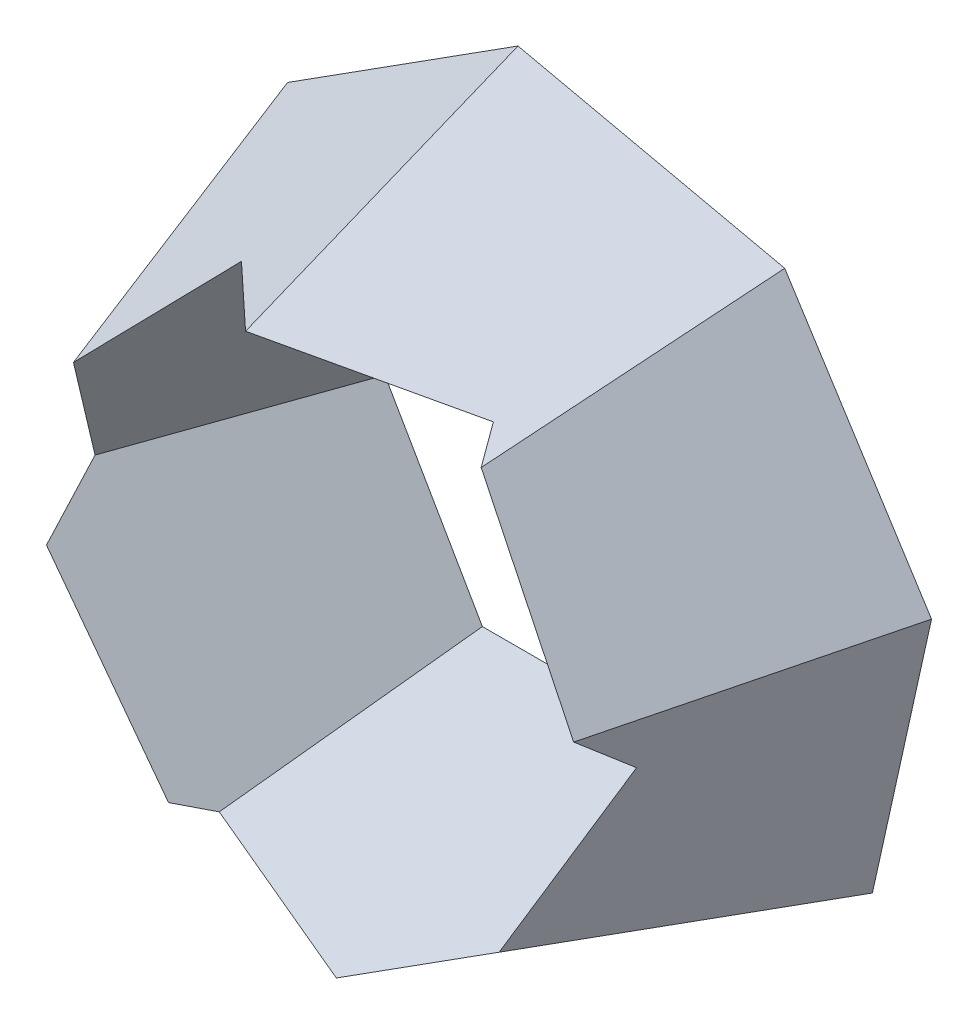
ISO-10303-21;
HEADER;
FILE_DESCRIPTION(('STEP AP214'),'2;1');
FILE_NAME('part.step','',(''),(''),'','','');
FILE_SCHEMA(('AUTOMOTIVE_DESIGN { 1 0 10303 214 1 1 1 1 }'));
ENDSEC;
DATA;
#1=APPLICATION_CONTEXT('core data for automotive mechanical design processes');
#2=APPLICATION_PROTOCOL_DEFINITION('international standard','automotive_design',2000,#1);
#3=PRODUCT_CONTEXT('',#1,'mechanical');
#4=PRODUCT('Part','Part','',(#3));
#5=PRODUCT_RELATED_PRODUCT_CATEGORY('part','',(#4));
#6=PRODUCT_DEFINITION_FORMATION('','',#4);
#7=PRODUCT_DEFINITION_CONTEXT('part definition',#1,'design');
#8=PRODUCT_DEFINITION('design','',#6,#7);
#9=PRODUCT_DEFINITION_SHAPE('','',#8);
#10=(LENGTH_UNIT() NAMED_UNIT(*) SI_UNIT(.MILLI.,.METRE.));
#11=(NAMED_UNIT(*) PLANE_ANGLE_UNIT() SI_UNIT($,.RADIAN.));
#12=(NAMED_UNIT(*) SI_UNIT($,.STERADIAN.) SOLID_ANGLE_UNIT());
#13=UNCERTAINTY_MEASURE_WITH_UNIT(LENGTH_MEASURE(1.E-05),#10,'distance_accuracy_value','');
#14=(GEOMETRIC_REPRESENTATION_CONTEXT(3) GLOBAL_UNCERTAINTY_ASSIGNED_CONTEXT((#13)) GLOBAL_UNIT_ASSIGNED_CONTEXT((#10,
#11,#12)) REPRESENTATION_CONTEXT('',''));
#15=CARTESIAN_POINT('',(0.,0.,0.));
#16=DIRECTION('',(0.,0.,1.));
#17=DIRECTION('',(1.,0.,0.));
#18=AXIS2_PLACEMENT_3D('',#15,#16,#17);
#19=CARTESIAN_POINT('',(12.9319936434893,58.3324536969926,0.));
#20=DIRECTION('',(0.,0.,-1.));
#21=DIRECTION('',(-1.,0.,0.));
#22=AXIS2_PLACEMENT_3D('',#19,#20,#21);
#23=PLANE('',#22);
#24=DIRECTION('',(-0.843391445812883,-0.537299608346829,0.));
#25=VECTOR('',#24,1.);
#26=CARTESIAN_POINT('',(-7.94087972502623,45.0349668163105,0.));
#27=LINE('',#26,#25);
#28=CARTESIAN_POINT('',(-7.94087972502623,45.0349668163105,0.));
#29=VERTEX_POINT('',#28);
#30=CARTESIAN_POINT('',(-37.4595803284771,26.2294805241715,0.));
#31=VERTEX_POINT('',#30);
#32=EDGE_CURVE('E139',#29,#31,#27,.T.);
#33=ORIENTED_EDGE('',*,*,#32,.F.);
#34=DIRECTION('',(-0.976296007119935,0.216439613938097,0.));
#35=VECTOR('',#34,1.);
#36=CARTESIAN_POINT('',(26.2294805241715,37.4595803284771,0.));
#37=LINE('',#36,#35);
#38=CARTESIAN_POINT('',(26.2294805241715,37.4595803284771,0.));
#39=VERTEX_POINT('',#38);
#40=EDGE_CURVE('E184',#39,#29,#37,.T.);
#41=ORIENTED_EDGE('',*,*,#40,.F.);
#42=DIRECTION('',(-0.537299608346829,0.843391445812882,0.));
#43=VECTOR('',#42,1.);
#44=CARTESIAN_POINT('',(45.0349668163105,7.94087972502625,0.));
#45=LINE('',#44,#43);
#46=CARTESIAN_POINT('',(45.0349668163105,7.94087972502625,0.));
#47=VERTEX_POINT('',#46);
#48=EDGE_CURVE('E181',#47,#39,#45,.T.);
#49=ORIENTED_EDGE('',*,*,#48,.F.);
#50=DIRECTION('',(0.216439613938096,0.976296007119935,0.));
#51=VECTOR('',#50,1.);
#52=CARTESIAN_POINT('',(37.4595803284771,-26.2294805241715,0.));
#53=LINE('',#52,#51);
#54=CARTESIAN_POINT('',(37.4595803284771,-26.2294805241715,0.));
#55=VERTEX_POINT('',#54);
#56=EDGE_CURVE('E178',#55,#47,#53,.T.);
#57=ORIENTED_EDGE('',*,*,#56,.F.);
#58=DIRECTION('',(0.843391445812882,0.537299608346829,0.));
#59=VECTOR('',#58,1.);
#60=CARTESIAN_POINT('',(7.94087972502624,-45.0349668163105,0.));
#61=LINE('',#60,#59);
#62=CARTESIAN_POINT('',(7.94087972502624,-45.0349668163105,0.));
#63=VERTEX_POINT('',#62);
#64=EDGE_CURVE('E175',#63,#55,#61,.T.);
#65=ORIENTED_EDGE('',*,*,#64,.F.);
#66=DIRECTION('',(0.976296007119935,-0.216439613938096,0.));
#67=VECTOR('',#66,1.);
#68=CARTESIAN_POINT('',(-26.2294805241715,-37.4595803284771,0.));
#69=LINE('',#68,#67);
#70=CARTESIAN_POINT('',(-26.2294805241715,-37.4595803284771,0.));
#71=VERTEX_POINT('',#70);
#72=EDGE_CURVE('E172',#71,#63,#69,.T.);
#73=ORIENTED_EDGE('',*,*,#72,.F.);
#74=DIRECTION('',(0.537299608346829,-0.843391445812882,0.));
#75=VECTOR('',#74,1.);
#76=CARTESIAN_POINT('',(-45.0349668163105,-7.94087972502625,0.));
#77=LINE('',#76,#75);
#78=CARTESIAN_POINT('',(-45.0349668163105,-7.94087972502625,0.));
#79=VERTEX_POINT('',#78);
#80=EDGE_CURVE('E169',#79,#71,#77,.T.);
#81=ORIENTED_EDGE('',*,*,#80,.F.);
#82=DIRECTION('',(-0.216439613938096,-0.976296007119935,0.));
#83=VECTOR('',#82,1.);
#84=CARTESIAN_POINT('',(-37.4595803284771,26.2294805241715,0.));
#85=LINE('',#84,#83);
#86=EDGE_CURVE('E166',#31,#79,#85,.T.);
#87=ORIENTED_EDGE('',*,*,#86,.F.);
#88=EDGE_LOOP('',(#33,#41,#49,#57,#65,#73,#81,#87));
#89=FACE_BOUND('',#88,.T.);
#90=DIRECTION('',(1.,0.,0.));
#91=VECTOR('',#90,1.);
#92=CARTESIAN_POINT('',(-12.5,-21.650635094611,0.));
#93=LINE('',#92,#91);
#94=CARTESIAN_POINT('',(-12.5,-21.650635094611,0.));
#95=VERTEX_POINT('',#94);
#96=CARTESIAN_POINT('',(12.5,-21.650635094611,0.));
#97=VERTEX_POINT('',#96);
#98=EDGE_CURVE('E153',#95,#97,#93,.T.);
#99=ORIENTED_EDGE('',*,*,#98,.T.);
#100=DIRECTION('',(0.5,0.866025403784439,0.));
#101=VECTOR('',#100,1.);
#102=CARTESIAN_POINT('',(12.5,-21.650635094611,0.));
#103=LINE('',#102,#101);
#104=CARTESIAN_POINT('',(25.,0.,0.));
#105=VERTEX_POINT('',#104);
#106=EDGE_CURVE('E134',#97,#105,#103,.T.);
#107=ORIENTED_EDGE('',*,*,#106,.T.);
#108=DIRECTION('',(-0.5,0.866025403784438,0.));
#109=VECTOR('',#108,1.);
#110=CARTESIAN_POINT('',(25.,0.,0.));
#111=LINE('',#110,#109);
#112=CARTESIAN_POINT('',(12.5,21.650635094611,0.));
#113=VERTEX_POINT('',#112);
#114=EDGE_CURVE('E143',#105,#113,#111,.T.);
#115=ORIENTED_EDGE('',*,*,#114,.T.);
#116=DIRECTION('',(-1.,0.,0.));
#117=VECTOR('',#116,1.);
#118=CARTESIAN_POINT('',(12.5,21.650635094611,0.));
#119=LINE('',#118,#117);
#120=CARTESIAN_POINT('',(-12.5,21.650635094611,0.));
#121=VERTEX_POINT('',#120);
#122=EDGE_CURVE('E149',#113,#121,#119,.T.);
#123=ORIENTED_EDGE('',*,*,#122,.T.);
#124=DIRECTION('',(-0.5,-0.866025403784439,0.));
#125=VECTOR('',#124,1.);
#126=CARTESIAN_POINT('',(-12.5,21.650635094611,0.));
#127=LINE('',#126,#125);
#128=CARTESIAN_POINT('',(-25.,0.,0.));
#129=VERTEX_POINT('',#128);
#130=EDGE_CURVE('E157',#121,#129,#127,.T.);
#131=ORIENTED_EDGE('',*,*,#130,.T.);
#132=DIRECTION('',(0.5,-0.866025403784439,0.));
#133=VECTOR('',#132,1.);
#134=CARTESIAN_POINT('',(-25.,0.,0.));
#135=LINE('',#134,#133);
#136=EDGE_CURVE('E160',#129,#95,#135,.T.);
#137=ORIENTED_EDGE('',*,*,#136,.T.);
#138=EDGE_LOOP('',(#99,#107,#115,#123,#131,#137));
#139=FACE_BOUND('',#138,.T.);
#140=ADVANCED_FACE('F31',(#89,#139),#23,.T.);
#141=CARTESIAN_POINT('',(-7.94087972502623,45.0349668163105,0.));
#142=DIRECTION('',(-0.513822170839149,0.8065392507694,0.292371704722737));
#143=DIRECTION('',(-0.843391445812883,-0.537299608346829,0.));
#144=AXIS2_PLACEMENT_3D('',#141,#142,#143);
#145=PLANE('',#144);
#146=DIRECTION('',(0.708193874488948,0.206419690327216,0.67516838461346));
#147=VECTOR('',#146,1.);
#148=CARTESIAN_POINT('',(-22.8189869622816,28.0128996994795,20.8100298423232));
#149=LINE('',#148,#147);
#150=CARTESIAN_POINT('',(-5.81342457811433,32.9695691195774,37.0225649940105));
#151=VERTEX_POINT('',#150);
#152=CARTESIAN_POINT('',(-17.1305227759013,29.6709358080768,26.23322158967));
#153=VERTEX_POINT('',#152);
#154=EDGE_CURVE('E213',#151,#153,#149,.F.);
#155=ORIENTED_EDGE('',*,*,#154,.F.);
#156=DIRECTION('',(-0.0545542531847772,0.309392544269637,-0.949368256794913));
#157=VECTOR('',#156,1.);
#158=CARTESIAN_POINT('',(-7.94087972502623,45.0349668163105,0.));
#159=LINE('',#158,#157);
#160=EDGE_CURVE('E187',#151,#29,#159,.T.);
#161=ORIENTED_EDGE('',*,*,#160,.T.);
#162=ORIENTED_EDGE('',*,*,#32,.T.);
#163=DIRECTION('',(-0.257349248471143,0.180197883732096,-0.949368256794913));
#164=VECTOR('',#163,1.);
#165=CARTESIAN_POINT('',(-37.4595803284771,26.2294805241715,0.));
#166=LINE('',#165,#164);
#167=CARTESIAN_POINT('',(-27.2610822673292,19.0884153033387,37.6225319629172));
#168=VERTEX_POINT('',#167);
#169=EDGE_CURVE('E188',#168,#31,#166,.T.);
#170=ORIENTED_EDGE('',*,*,#169,.F.);
#171=DIRECTION('',(0.545937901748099,0.570294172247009,-0.613772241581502));
#172=VECTOR('',#171,1.);
#173=CARTESIAN_POINT('',(-0.817780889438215,46.7114482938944,7.89357504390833));
#174=LINE('',#173,#172);
#175=EDGE_CURVE('E190',#153,#168,#174,.F.);
#176=ORIENTED_EDGE('',*,*,#175,.F.);
#177=EDGE_LOOP('',(#155,#161,#162,#170,#176));
#178=FACE_BOUND('',#177,.T.);
#179=ADVANCED_FACE('F241',(#178),#145,.T.);
#180=CARTESIAN_POINT('',(-37.4595803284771,26.2294805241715,0.));
#181=DIRECTION('',(-0.933636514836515,0.206982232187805,0.292371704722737));
#182=DIRECTION('',(0.298843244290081,0.,0.954302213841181));
#183=AXIS2_PLACEMENT_3D('',#180,#181,#182);
#184=PLANE('',#183);
#185=DIRECTION('',(0.324488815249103,0.834421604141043,0.445474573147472));
#186=VECTOR('',#185,1.);
#187=CARTESIAN_POINT('',(-31.8397884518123,7.31429188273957,31.3366537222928));
#188=LINE('',#187,#186);
#189=CARTESIAN_POINT('',(-34.6841610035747,0.,27.4317559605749));
#190=VERTEX_POINT('',#189);
#191=EDGE_CURVE('E218',#168,#190,#188,.F.);
#192=ORIENTED_EDGE('',*,*,#191,.F.);
#193=ORIENTED_EDGE('',*,*,#169,.T.);
#194=ORIENTED_EDGE('',*,*,#86,.T.);
#195=DIRECTION('',(-0.309392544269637,-0.0545542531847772,-0.949368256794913));
#196=VECTOR('',#195,1.);
#197=CARTESIAN_POINT('',(-45.0349668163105,-7.94087972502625,0.));
#198=LINE('',#197,#196);
#199=CARTESIAN_POINT('',(-33.7677278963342,-5.95416150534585,34.5734219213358));
#200=VERTEX_POINT('',#199);
#201=EDGE_CURVE('E191',#200,#79,#198,.T.);
#202=ORIENTED_EDGE('',*,*,#201,.F.);
#203=DIRECTION('',(-0.0980856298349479,0.637272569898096,-0.764370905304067));
#204=VECTOR('',#203,1.);
#205=CARTESIAN_POINT('',(-38.4070592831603,24.1880585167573,-1.58039529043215));
#206=LINE('',#205,#204);
#207=EDGE_CURVE('E216',#190,#200,#206,.F.);
#208=ORIENTED_EDGE('',*,*,#207,.F.);
#209=EDGE_LOOP('',(#192,#193,#194,#202,#208));
#210=FACE_BOUND('',#209,.T.);
#211=ADVANCED_FACE('F253',(#210),#184,.T.);
#212=CARTESIAN_POINT('',(-45.0349668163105,-7.94087972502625,0.));
#213=DIRECTION('',(-0.8065392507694,-0.513822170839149,0.292371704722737));
#214=DIRECTION('',(0.537299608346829,-0.843391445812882,0.));
#215=AXIS2_PLACEMENT_3D('',#212,#213,#214);
#216=PLANE('',#215);
#217=DIRECTION('',(-0.517457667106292,0.85274384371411,0.071172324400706));
#218=VECTOR('',#217,1.);
#219=CARTESIAN_POINT('',(-34.6347213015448,-4.52540059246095,34.692670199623));
#220=LINE('',#219,#218);
#221=CARTESIAN_POINT('',(-20.0259142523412,-28.59996952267,32.6833410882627));
#222=VERTEX_POINT('',#221);
#223=EDGE_CURVE('E220',#200,#222,#220,.F.);
#224=ORIENTED_EDGE('',*,*,#223,.F.);
#225=ORIENTED_EDGE('',*,*,#201,.T.);
#226=ORIENTED_EDGE('',*,*,#80,.T.);
#227=DIRECTION('',(-0.180197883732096,-0.257349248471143,-0.949368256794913));
#228=VECTOR('',#227,1.);
#229=CARTESIAN_POINT('',(-26.2294805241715,-37.4595803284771,0.));
#230=LINE('',#229,#228);
#231=EDGE_CURVE('E201',#222,#71,#230,.T.);
#232=ORIENTED_EDGE('',*,*,#231,.F.);
#233=EDGE_LOOP('',(#224,#225,#226,#232));
#234=FACE_BOUND('',#233,.T.);
#235=ADVANCED_FACE('F284',(#234),#216,.T.);
#236=CARTESIAN_POINT('',(-26.2294805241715,-37.4595803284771,0.));
#237=DIRECTION('',(-0.206982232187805,-0.933636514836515,0.292371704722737));
#238=DIRECTION('',(0.,-0.298843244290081,-0.954302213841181));
#239=AXIS2_PLACEMENT_3D('',#236,#237,#238);
#240=PLANE('',#239);
#241=DIRECTION('',(-0.487605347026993,0.357527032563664,0.796502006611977));
#242=VECTOR('',#241,1.);
#243=CARTESIAN_POINT('',(-7.26284183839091,-37.9582414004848,11.834897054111));
#244=LINE('',#243,#242);
#245=CARTESIAN_POINT('',(-17.5572581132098,-30.4100630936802,28.6507980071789));
#246=VERTEX_POINT('',#245);
#247=EDGE_CURVE('E225',#222,#246,#244,.F.);
#248=ORIENTED_EDGE('',*,*,#247,.F.);
#249=ORIENTED_EDGE('',*,*,#231,.T.);
#250=ORIENTED_EDGE('',*,*,#72,.T.);
#251=DIRECTION('',(0.0545542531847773,-0.309392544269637,-0.949368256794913));
#252=VECTOR('',#251,1.);
#253=CARTESIAN_POINT('',(7.94087972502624,-45.0349668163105,0.));
#254=LINE('',#253,#252);
#255=CARTESIAN_POINT('',(5.81342457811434,-32.9695691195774,37.0225649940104));
#256=VERTEX_POINT('',#255);
#257=EDGE_CURVE('E199',#256,#63,#254,.T.);
#258=ORIENTED_EDGE('',*,*,#257,.F.);
#259=DIRECTION('',(-0.936457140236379,0.102558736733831,-0.335454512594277));
#260=VECTOR('',#259,1.);
#261=CARTESIAN_POINT('',(-33.4856584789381,-28.6656195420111,22.9449802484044));
#262=LINE('',#261,#260);
#263=EDGE_CURVE('E222',#246,#256,#262,.F.);
#264=ORIENTED_EDGE('',*,*,#263,.F.);
#265=EDGE_LOOP('',(#248,#249,#250,#258,#264));
#266=FACE_BOUND('',#265,.T.);
#267=ADVANCED_FACE('F280',(#266),#240,.T.);
#268=CARTESIAN_POINT('',(7.94087972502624,-45.0349668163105,0.));
#269=DIRECTION('',(0.513822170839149,-0.8065392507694,0.292371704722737));
#270=DIRECTION('',(0.843391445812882,0.537299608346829,0.));
#271=AXIS2_PLACEMENT_3D('',#268,#269,#270);
#272=PLANE('',#271);
#273=DIRECTION('',(-0.708193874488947,-0.206419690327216,0.67516838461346));
#274=VECTOR('',#273,1.);
#275=CARTESIAN_POINT('',(22.8189869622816,-28.0128996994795,20.8100298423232));
#276=LINE('',#275,#274);
#277=CARTESIAN_POINT('',(17.1305227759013,-29.6709358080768,26.2332215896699));
#278=VERTEX_POINT('',#277);
#279=EDGE_CURVE('E229',#256,#278,#276,.F.);
#280=ORIENTED_EDGE('',*,*,#279,.F.);
#281=ORIENTED_EDGE('',*,*,#257,.T.);
#282=ORIENTED_EDGE('',*,*,#64,.T.);
#283=DIRECTION('',(0.257349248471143,-0.180197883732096,-0.949368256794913));
#284=VECTOR('',#283,1.);
#285=CARTESIAN_POINT('',(37.4595803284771,-26.2294805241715,0.));
#286=LINE('',#285,#284);
#287=CARTESIAN_POINT('',(27.2610822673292,-19.0884153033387,37.6225319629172));
#288=VERTEX_POINT('',#287);
#289=EDGE_CURVE('E197',#288,#55,#286,.T.);
#290=ORIENTED_EDGE('',*,*,#289,.F.);
#291=DIRECTION('',(-0.545937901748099,-0.570294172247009,-0.613772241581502));
#292=VECTOR('',#291,1.);
#293=CARTESIAN_POINT('',(0.817780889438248,-46.7114482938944,7.8935750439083));
#294=LINE('',#293,#292);
#295=EDGE_CURVE('E227',#278,#288,#294,.F.);
#296=ORIENTED_EDGE('',*,*,#295,.F.);
#297=EDGE_LOOP('',(#280,#281,#282,#290,#296));
#298=FACE_BOUND('',#297,.T.);
#299=ADVANCED_FACE('F269',(#298),#272,.T.);
#300=CARTESIAN_POINT('',(37.4595803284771,-26.2294805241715,0.));
#301=DIRECTION('',(0.933636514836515,-0.206982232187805,0.292371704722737));
#302=DIRECTION('',(0.298843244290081,0.,-0.954302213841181));
#303=AXIS2_PLACEMENT_3D('',#300,#301,#302);
#304=PLANE('',#303);
#305=DIRECTION('',(0.098085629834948,-0.637272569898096,-0.764370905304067));
#306=VECTOR('',#305,1.);
#307=CARTESIAN_POINT('',(38.4070592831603,-24.1880585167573,-1.58039529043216));
#308=LINE('',#307,#306);
#309=CARTESIAN_POINT('',(34.6841610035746,0.,27.4317559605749));
#310=VERTEX_POINT('',#309);
#311=CARTESIAN_POINT('',(33.7677278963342,5.95416150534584,34.5734219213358));
#312=VERTEX_POINT('',#311);
#313=EDGE_CURVE('E233',#310,#312,#308,.F.);
#314=ORIENTED_EDGE('',*,*,#313,.F.);
#315=DIRECTION('',(-0.324488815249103,-0.834421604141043,0.445474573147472));
#316=VECTOR('',#315,1.);
#317=CARTESIAN_POINT('',(31.8397884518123,-7.31429188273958,31.3366537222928));
#318=LINE('',#317,#316);
#319=EDGE_CURVE('E136',#288,#310,#318,.F.);
#320=ORIENTED_EDGE('',*,*,#319,.F.);
#321=ORIENTED_EDGE('',*,*,#289,.T.);
#322=ORIENTED_EDGE('',*,*,#56,.T.);
#323=DIRECTION('',(0.309392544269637,0.0545542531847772,-0.949368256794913));
#324=VECTOR('',#323,1.);
#325=CARTESIAN_POINT('',(45.0349668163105,7.94087972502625,0.));
#326=LINE('',#325,#324);
#327=EDGE_CURVE('E195',#312,#47,#326,.T.);
#328=ORIENTED_EDGE('',*,*,#327,.F.);
#329=EDGE_LOOP('',(#314,#320,#321,#322,#328));
#330=FACE_BOUND('',#329,.T.);
#331=ADVANCED_FACE('F273',(#330),#304,.T.);
#332=CARTESIAN_POINT('',(45.0349668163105,7.94087972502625,0.));
#333=DIRECTION('',(0.8065392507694,0.513822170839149,0.292371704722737));
#334=DIRECTION('',(-0.537299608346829,0.843391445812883,0.));
#335=AXIS2_PLACEMENT_3D('',#332,#333,#334);
#336=PLANE('',#335);
#337=DIRECTION('',(0.517457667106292,-0.85274384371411,0.0711723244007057));
#338=VECTOR('',#337,1.);
#339=CARTESIAN_POINT('',(34.6347213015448,4.52540059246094,34.6926701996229));
#340=LINE('',#339,#338);
#341=CARTESIAN_POINT('',(20.0259142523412,28.59996952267,32.6833410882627));
#342=VERTEX_POINT('',#341);
#343=EDGE_CURVE('E235',#312,#342,#340,.F.);
#344=ORIENTED_EDGE('',*,*,#343,.F.);
#345=ORIENTED_EDGE('',*,*,#327,.T.);
#346=ORIENTED_EDGE('',*,*,#48,.T.);
#347=DIRECTION('',(0.180197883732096,0.257349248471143,-0.949368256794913));
#348=VECTOR('',#347,1.);
#349=CARTESIAN_POINT('',(26.2294805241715,37.4595803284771,0.));
#350=LINE('',#349,#348);
#351=EDGE_CURVE('E193',#342,#39,#350,.T.);
#352=ORIENTED_EDGE('',*,*,#351,.F.);
#353=EDGE_LOOP('',(#344,#345,#346,#352));
#354=FACE_BOUND('',#353,.T.);
#355=ADVANCED_FACE('F276',(#354),#336,.T.);
#356=CARTESIAN_POINT('',(26.2294805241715,37.4595803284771,0.));
#357=DIRECTION('',(0.206982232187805,0.933636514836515,0.292371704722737));
#358=DIRECTION('',(0.,-0.298843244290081,0.954302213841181));
#359=AXIS2_PLACEMENT_3D('',#356,#357,#358);
#360=PLANE('',#359);
#361=DIRECTION('',(0.487605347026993,-0.357527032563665,0.796502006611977));
#362=VECTOR('',#361,1.);
#363=CARTESIAN_POINT('',(7.2628418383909,37.9582414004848,11.834897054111));
#364=LINE('',#363,#362);
#365=CARTESIAN_POINT('',(17.5572581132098,30.4100630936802,28.6507980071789));
#366=VERTEX_POINT('',#365);
#367=EDGE_CURVE('E11',#342,#366,#364,.F.);
#368=ORIENTED_EDGE('',*,*,#367,.F.);
#369=ORIENTED_EDGE('',*,*,#351,.T.);
#370=ORIENTED_EDGE('',*,*,#40,.T.);
#371=ORIENTED_EDGE('',*,*,#160,.F.);
#372=DIRECTION('',(0.936457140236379,-0.102558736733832,-0.335454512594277));
#373=VECTOR('',#372,1.);
#374=CARTESIAN_POINT('',(33.4856584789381,28.6656195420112,22.9449802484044));
#375=LINE('',#374,#373);
#376=EDGE_CURVE('E39',#366,#151,#375,.F.);
#377=ORIENTED_EDGE('',*,*,#376,.F.);
#378=EDGE_LOOP('',(#368,#369,#370,#371,#377));
#379=FACE_BOUND('',#378,.T.);
#380=ADVANCED_FACE('F243',(#379),#360,.T.);
#381=CARTESIAN_POINT('',(12.5,-21.650635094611,0.));
#382=DIRECTION('',(-0.828184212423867,0.478152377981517,0.292371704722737));
#383=DIRECTION('',(-0.5,-0.866025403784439,0.));
#384=AXIS2_PLACEMENT_3D('',#381,#382,#383);
#385=PLANE('',#384);
#386=ORIENTED_EDGE('',*,*,#295,.T.);
#387=ORIENTED_EDGE('',*,*,#319,.T.);
#388=DIRECTION('',(-0.332892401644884,0.,-0.942964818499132));
#389=VECTOR('',#388,1.);
#390=CARTESIAN_POINT('',(25.,0.,0.));
#391=LINE('',#390,#389);
#392=EDGE_CURVE('E128',#310,#105,#391,.T.);
#393=ORIENTED_EDGE('',*,*,#392,.T.);
#394=ORIENTED_EDGE('',*,*,#106,.F.);
#395=DIRECTION('',(-0.166446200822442,0.288293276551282,-0.942964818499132));
#396=VECTOR('',#395,1.);
#397=CARTESIAN_POINT('',(12.5,-21.650635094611,0.));
#398=LINE('',#397,#396);
#399=EDGE_CURVE('E163',#278,#97,#398,.T.);
#400=ORIENTED_EDGE('',*,*,#399,.F.);
#401=EDGE_LOOP('',(#386,#387,#393,#394,#400));
#402=FACE_BOUND('',#401,.T.);
#403=ADVANCED_FACE('F131',(#402),#385,.T.);
#404=CARTESIAN_POINT('',(25.,0.,0.));
#405=DIRECTION('',(-0.828184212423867,-0.478152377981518,0.292371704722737));
#406=DIRECTION('',(0.5,-0.866025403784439,0.));
#407=AXIS2_PLACEMENT_3D('',#404,#405,#406);
#408=PLANE('',#407);
#409=ORIENTED_EDGE('',*,*,#343,.T.);
#410=ORIENTED_EDGE('',*,*,#367,.T.);
#411=DIRECTION('',(-0.166446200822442,-0.288293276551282,-0.942964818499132));
#412=VECTOR('',#411,1.);
#413=CARTESIAN_POINT('',(12.5,21.650635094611,0.));
#414=LINE('',#413,#412);
#415=EDGE_CURVE('E140',#366,#113,#414,.T.);
#416=ORIENTED_EDGE('',*,*,#415,.T.);
#417=ORIENTED_EDGE('',*,*,#114,.F.);
#418=ORIENTED_EDGE('',*,*,#392,.F.);
#419=ORIENTED_EDGE('',*,*,#313,.T.);
#420=EDGE_LOOP('',(#409,#410,#416,#417,#418,#419));
#421=FACE_BOUND('',#420,.T.);
#422=ADVANCED_FACE('F144',(#421),#408,.T.);
#423=CARTESIAN_POINT('',(12.5,21.650635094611,0.));
#424=DIRECTION('',(0.,-0.956304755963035,0.292371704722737));
#425=DIRECTION('',(0.,-0.292371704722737,-0.956304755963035));
#426=AXIS2_PLACEMENT_3D('',#423,#424,#425);
#427=PLANE('',#426);
#428=ORIENTED_EDGE('',*,*,#415,.F.);
#429=ORIENTED_EDGE('',*,*,#376,.T.);
#430=ORIENTED_EDGE('',*,*,#154,.T.);
#431=DIRECTION('',(0.166446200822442,-0.288293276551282,-0.942964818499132));
#432=VECTOR('',#431,1.);
#433=CARTESIAN_POINT('',(-12.5,21.650635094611,0.));
#434=LINE('',#433,#432);
#435=EDGE_CURVE('E209',#153,#121,#434,.T.);
#436=ORIENTED_EDGE('',*,*,#435,.T.);
#437=ORIENTED_EDGE('',*,*,#122,.F.);
#438=EDGE_LOOP('',(#428,#429,#430,#436,#437));
#439=FACE_BOUND('',#438,.T.);
#440=ADVANCED_FACE('F238',(#439),#427,.T.);
#441=CARTESIAN_POINT('',(-12.5,21.650635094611,0.));
#442=DIRECTION('',(0.828184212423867,-0.478152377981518,0.292371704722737));
#443=DIRECTION('',(0.5,0.866025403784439,0.));
#444=AXIS2_PLACEMENT_3D('',#441,#442,#443);
#445=PLANE('',#444);
#446=ORIENTED_EDGE('',*,*,#175,.T.);
#447=ORIENTED_EDGE('',*,*,#191,.T.);
#448=DIRECTION('',(0.332892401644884,0.,-0.942964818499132));
#449=VECTOR('',#448,1.);
#450=CARTESIAN_POINT('',(-25.,0.,0.));
#451=LINE('',#450,#449);
#452=EDGE_CURVE('E206',#190,#129,#451,.T.);
#453=ORIENTED_EDGE('',*,*,#452,.T.);
#454=ORIENTED_EDGE('',*,*,#130,.F.);
#455=ORIENTED_EDGE('',*,*,#435,.F.);
#456=EDGE_LOOP('',(#446,#447,#453,#454,#455));
#457=FACE_BOUND('',#456,.T.);
#458=ADVANCED_FACE('F258',(#457),#445,.T.);
#459=CARTESIAN_POINT('',(-25.,0.,0.));
#460=DIRECTION('',(0.828184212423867,0.478152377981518,0.292371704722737));
#461=DIRECTION('',(-0.5,0.866025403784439,0.));
#462=AXIS2_PLACEMENT_3D('',#459,#460,#461);
#463=PLANE('',#462);
#464=ORIENTED_EDGE('',*,*,#223,.T.);
#465=ORIENTED_EDGE('',*,*,#247,.T.);
#466=DIRECTION('',(0.166446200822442,0.288293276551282,-0.942964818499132));
#467=VECTOR('',#466,1.);
#468=CARTESIAN_POINT('',(-12.5,-21.650635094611,0.));
#469=LINE('',#468,#467);
#470=EDGE_CURVE('E204',#246,#95,#469,.T.);
#471=ORIENTED_EDGE('',*,*,#470,.T.);
#472=ORIENTED_EDGE('',*,*,#136,.F.);
#473=ORIENTED_EDGE('',*,*,#452,.F.);
#474=ORIENTED_EDGE('',*,*,#207,.T.);
#475=EDGE_LOOP('',(#464,#465,#471,#472,#473,#474));
#476=FACE_BOUND('',#475,.T.);
#477=ADVANCED_FACE('F33',(#476),#463,.T.);
#478=CARTESIAN_POINT('',(-12.5,-21.650635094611,0.));
#479=DIRECTION('',(0.,0.956304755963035,0.292371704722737));
#480=DIRECTION('',(0.,-0.292371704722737,0.956304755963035));
#481=AXIS2_PLACEMENT_3D('',#478,#479,#480);
#482=PLANE('',#481);
#483=ORIENTED_EDGE('',*,*,#263,.T.);
#484=ORIENTED_EDGE('',*,*,#279,.T.);
#485=ORIENTED_EDGE('',*,*,#399,.T.);
#486=ORIENTED_EDGE('',*,*,#98,.F.);
#487=ORIENTED_EDGE('',*,*,#470,.F.);
#488=EDGE_LOOP('',(#483,#484,#485,#486,#487));
#489=FACE_BOUND('',#488,.T.);
#490=ADVANCED_FACE('F266',(#489),#482,.T.);
#491=CLOSED_SHELL('',(#140,#179,#211,#235,#267,#299,#331,#355,#380,#403,#422,#440,#458,#477,#490));
#492=MANIFOLD_SOLID_BREP('B2',#491);
#493=ADVANCED_BREP_SHAPE_REPRESENTATION('',(#18,#492),#14);
#494=SHAPE_DEFINITION_REPRESENTATION(#9,#493);
ENDSEC;
END-ISO-10303-21;
